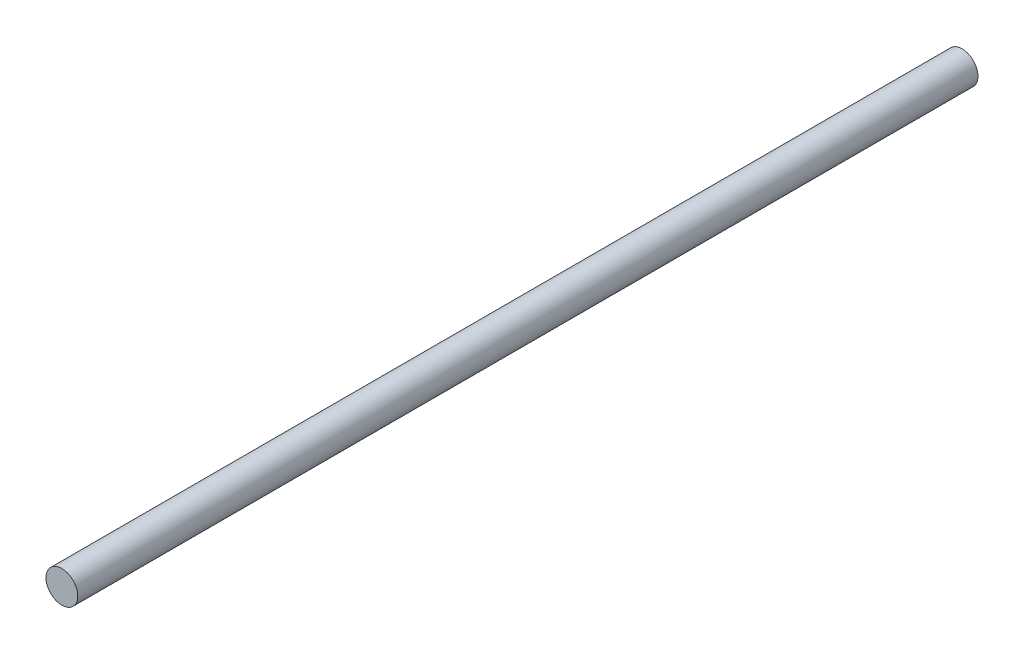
from build123d import *

# Parameters (mm, degrees)
SKETCH1_R           = 30
BOSS_EXTRUDE1_DEPTH = 1700


with BuildPart() as part:
    # Sketch1 → Boss-Extrude1 (new body)
    with BuildSketch(Plane.XY):
        Circle(SKETCH1_R)
    extrude(amount=-BOSS_EXTRUDE1_DEPTH)


solid = part.part
